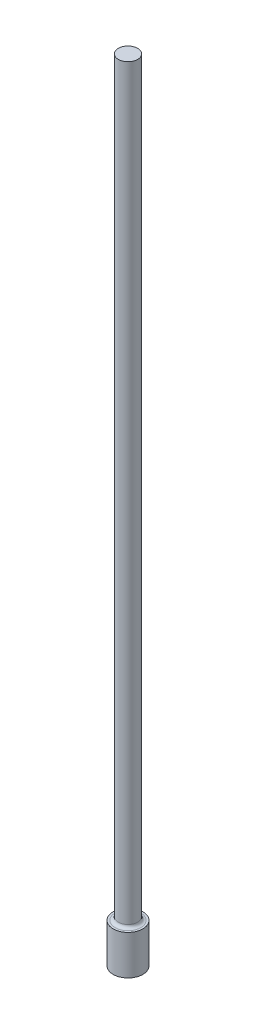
from build123d import *


with BuildPart() as part:
    # Sketch1 → Revolve3 (revolve)
    with BuildSketch(Plane.XY, mode=Mode.PRIVATE) as revolve3_sk:
        with BuildLine():
            Line((0, 0), (1.1938, 0))
            Line((1.1938, 0), (1.1938, 3.175))
            Line((1.1938, 3.175), (1.0287, 3.175))
            ThreePointArc((1.0287, 3.175), (0.849094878, 3.249394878), (0.7747, 3.429))
            Line((0.7747, 3.429), (0.7747, 63.5))
            Line((0.7747, 63.5), (0, 63.5))
            Line((0, 63.5), (0, 0))
        make_face()
    revolve(revolve3_sk.sketch.rotate(Axis((0, 0, 0), (0, -1, 0)), 90), axis=Axis((0, 0, 0), (0, -1, 0)))


solid = part.part
